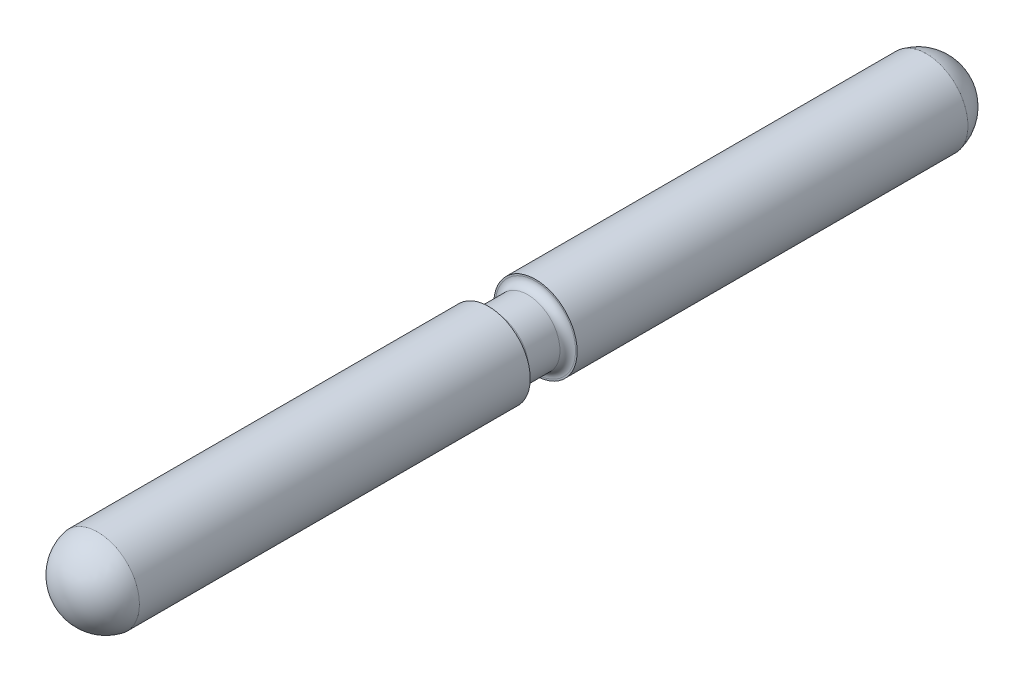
from build123d import *

# Parameters (mm, degrees)
CONG_1_R = 1.5


with BuildPart() as part:
    # Esquisse1 → Base-R_volution (revolve)
    with BuildSketch(Plane(origin=(0, 0, 0), x_dir=(0, 0, -1), z_dir=(1, 0, 0)), mode=Mode.PRIVATE) as base_r_volution_sk:
        with BuildLine():
            Line((-85.5, 8), (-10.5, 8))
            Line((-10.5, 8), (-10.5, 6.2))
            Line((-10.5, 6.2), (-1.5, 6.2))
            Line((-1.5, 6.2), (-1.5, 8))
            Line((-1.5, 8), (73.5, 8))
            ThreePointArc((73.5, 8), (78.198975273, 5.181357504), (79.981851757, 0))
            Line((79.981851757, 0), (-91.981851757, 0))
            ThreePointArc((-91.981851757, 0), (-90.198975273, 5.181357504), (-85.5, 8))
        make_face()
    revolve(base_r_volution_sk.sketch.rotate(Axis((0, 0, 100), (0, 0, -1)), 90), axis=Axis((0, 0, 100), (0, 0, -1)))

    # Cong_1
    cong_1_edges = [part.edges().sort_by_distance(p)[0] for p in [
        (-6.2, 0, 10.5),
        (-6.2, 0, 1.5),
    ]]
    fillet(cong_1_edges, radius=CONG_1_R)


solid = part.part
